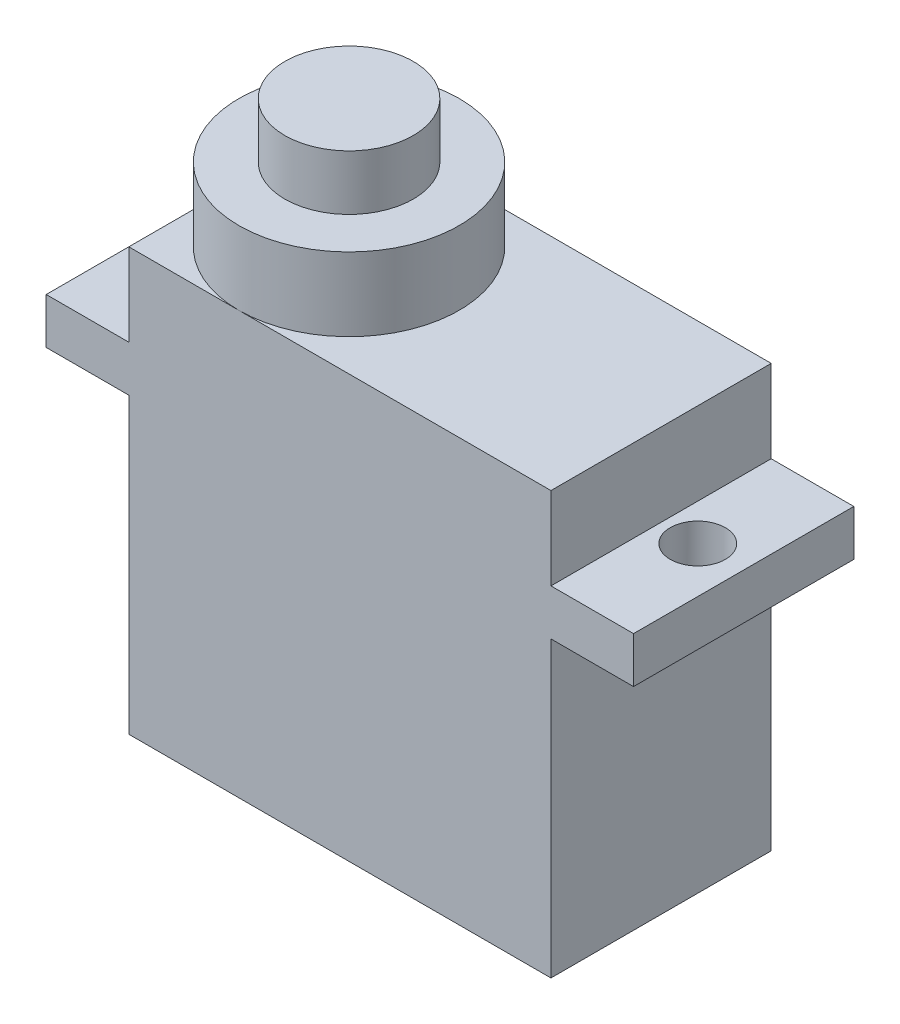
ISO-10303-21;
HEADER;
FILE_DESCRIPTION(('STEP AP214'),'2;1');
FILE_NAME('part.step','',(''),(''),'','','');
FILE_SCHEMA(('AUTOMOTIVE_DESIGN { 1 0 10303 214 1 1 1 1 }'));
ENDSEC;
DATA;
#1=APPLICATION_CONTEXT('core data for automotive mechanical design processes');
#2=APPLICATION_PROTOCOL_DEFINITION('international standard','automotive_design',2000,#1);
#3=PRODUCT_CONTEXT('',#1,'mechanical');
#4=PRODUCT('Part','Part','',(#3));
#5=PRODUCT_RELATED_PRODUCT_CATEGORY('part','',(#4));
#6=PRODUCT_DEFINITION_FORMATION('','',#4);
#7=PRODUCT_DEFINITION_CONTEXT('part definition',#1,'design');
#8=PRODUCT_DEFINITION('design','',#6,#7);
#9=PRODUCT_DEFINITION_SHAPE('','',#8);
#10=(LENGTH_UNIT() NAMED_UNIT(*) SI_UNIT(.MILLI.,.METRE.));
#11=(NAMED_UNIT(*) PLANE_ANGLE_UNIT() SI_UNIT($,.RADIAN.));
#12=(NAMED_UNIT(*) SI_UNIT($,.STERADIAN.) SOLID_ANGLE_UNIT());
#13=UNCERTAINTY_MEASURE_WITH_UNIT(LENGTH_MEASURE(1.E-05),#10,'distance_accuracy_value','');
#14=(GEOMETRIC_REPRESENTATION_CONTEXT(3) GLOBAL_UNCERTAINTY_ASSIGNED_CONTEXT((#13)) GLOBAL_UNIT_ASSIGNED_CONTEXT((#10,
#11,#12)) REPRESENTATION_CONTEXT('',''));
#15=CARTESIAN_POINT('',(0.,0.,0.));
#16=DIRECTION('',(0.,0.,1.));
#17=DIRECTION('',(1.,0.,0.));
#18=AXIS2_PLACEMENT_3D('',#15,#16,#17);
#19=CARTESIAN_POINT('',(0.,23.,0.));
#20=DIRECTION('',(0.,-1.,0.));
#21=DIRECTION('',(0.,0.,-1.));
#22=AXIS2_PLACEMENT_3D('',#19,#20,#21);
#23=PLANE('',#22);
#24=CARTESIAN_POINT('',(10.5,23.,-6.));
#25=DIRECTION('',(0.,1.,0.));
#26=DIRECTION('',(0.,0.,1.));
#27=AXIS2_PLACEMENT_3D('',#24,#25,#26);
#28=CIRCLE('',#27,6.);
#29=CARTESIAN_POINT('',(10.5,23.,0.));
#30=VERTEX_POINT('',#29);
#31=CARTESIAN_POINT('',(10.5,23.,-12.));
#32=VERTEX_POINT('',#31);
#33=EDGE_CURVE('E158',#30,#32,#28,.T.);
#34=ORIENTED_EDGE('',*,*,#33,.F.);
#35=DIRECTION('',(1.,0.,0.));
#36=VECTOR('',#35,1.);
#37=CARTESIAN_POINT('',(0.,23.,0.));
#38=LINE('',#37,#36);
#39=CARTESIAN_POINT('',(27.5,23.,0.));
#40=VERTEX_POINT('',#39);
#41=EDGE_CURVE('E143',#30,#40,#38,.T.);
#42=ORIENTED_EDGE('',*,*,#41,.T.);
#43=DIRECTION('',(0.,0.,-1.));
#44=VECTOR('',#43,1.);
#45=CARTESIAN_POINT('',(27.5,23.,0.));
#46=LINE('',#45,#44);
#47=CARTESIAN_POINT('',(27.5,23.,-12.));
#48=VERTEX_POINT('',#47);
#49=EDGE_CURVE('E253',#40,#48,#46,.T.);
#50=ORIENTED_EDGE('',*,*,#49,.T.);
#51=DIRECTION('',(-1.,0.,0.));
#52=VECTOR('',#51,1.);
#53=CARTESIAN_POINT('',(0.,23.,-12.));
#54=LINE('',#53,#52);
#55=EDGE_CURVE('E160',#48,#32,#54,.T.);
#56=ORIENTED_EDGE('',*,*,#55,.T.);
#57=EDGE_LOOP('',(#34,#42,#50,#56));
#58=FACE_BOUND('',#57,.T.);
#59=ADVANCED_FACE('F37',(#58),#23,.F.);
#60=CARTESIAN_POINT('',(4.5,23.,-6.));
#61=VERTEX_POINT('',#60);
#62=EDGE_CURVE('E46',#32,#61,#28,.T.);
#63=ORIENTED_EDGE('',*,*,#62,.F.);
#64=CARTESIAN_POINT('',(4.5,23.,-12.));
#65=VERTEX_POINT('',#64);
#66=EDGE_CURVE('E142',#32,#65,#54,.T.);
#67=ORIENTED_EDGE('',*,*,#66,.T.);
#68=DIRECTION('',(0.,0.,1.));
#69=VECTOR('',#68,1.);
#70=CARTESIAN_POINT('',(4.5,23.,0.));
#71=LINE('',#70,#69);
#72=EDGE_CURVE('E251',#65,#61,#71,.T.);
#73=ORIENTED_EDGE('',*,*,#72,.T.);
#74=EDGE_LOOP('',(#63,#67,#73));
#75=FACE_BOUND('',#74,.T.);
#76=ADVANCED_FACE('F301',(#75),#23,.F.);
#77=CARTESIAN_POINT('',(0.,23.,0.));
#78=DIRECTION('',(1.,0.,0.));
#79=DIRECTION('',(0.,0.,-1.));
#80=AXIS2_PLACEMENT_3D('',#77,#78,#79);
#81=PLANE('',#80);
#82=DIRECTION('',(0.,-1.,0.));
#83=VECTOR('',#82,1.);
#84=CARTESIAN_POINT('',(0.,23.,0.));
#85=LINE('',#84,#83);
#86=CARTESIAN_POINT('',(0.,18.5,0.));
#87=VERTEX_POINT('',#86);
#88=CARTESIAN_POINT('',(0.,16.,0.));
#89=VERTEX_POINT('',#88);
#90=EDGE_CURVE('E244',#87,#89,#85,.T.);
#91=ORIENTED_EDGE('',*,*,#90,.F.);
#92=DIRECTION('',(0.,0.,1.));
#93=VECTOR('',#92,1.);
#94=CARTESIAN_POINT('',(0.,18.5,-23.));
#95=LINE('',#94,#93);
#96=CARTESIAN_POINT('',(0.,18.5,-12.));
#97=VERTEX_POINT('',#96);
#98=EDGE_CURVE('E189',#97,#87,#95,.T.);
#99=ORIENTED_EDGE('',*,*,#98,.F.);
#100=DIRECTION('',(0.,-1.,0.));
#101=VECTOR('',#100,1.);
#102=CARTESIAN_POINT('',(0.,23.,-12.));
#103=LINE('',#102,#101);
#104=CARTESIAN_POINT('',(0.,16.,-12.));
#105=VERTEX_POINT('',#104);
#106=EDGE_CURVE('E232',#97,#105,#103,.T.);
#107=ORIENTED_EDGE('',*,*,#106,.T.);
#108=DIRECTION('',(0.,0.,1.));
#109=VECTOR('',#108,1.);
#110=CARTESIAN_POINT('',(0.,16.,-23.));
#111=LINE('',#110,#109);
#112=EDGE_CURVE('E214',#105,#89,#111,.T.);
#113=ORIENTED_EDGE('',*,*,#112,.T.);
#114=EDGE_LOOP('',(#91,#99,#107,#113));
#115=FACE_BOUND('',#114,.T.);
#116=ADVANCED_FACE('F39',(#115),#81,.F.);
#117=CARTESIAN_POINT('',(0.,23.,0.));
#118=DIRECTION('',(0.,0.,-1.));
#119=DIRECTION('',(-1.,0.,0.));
#120=AXIS2_PLACEMENT_3D('',#117,#118,#119);
#121=PLANE('',#120);
#122=DIRECTION('',(1.,0.,0.));
#123=VECTOR('',#122,1.);
#124=CARTESIAN_POINT('',(0.,0.,0.));
#125=LINE('',#124,#123);
#126=CARTESIAN_POINT('',(4.5,0.,0.));
#127=VERTEX_POINT('',#126);
#128=CARTESIAN_POINT('',(27.5,0.,0.));
#129=VERTEX_POINT('',#128);
#130=EDGE_CURVE('E229',#127,#129,#125,.T.);
#131=ORIENTED_EDGE('',*,*,#130,.T.);
#132=DIRECTION('',(0.,-1.,0.));
#133=VECTOR('',#132,1.);
#134=CARTESIAN_POINT('',(27.5,0.,0.));
#135=LINE('',#134,#133);
#136=CARTESIAN_POINT('',(27.5,16.,0.));
#137=VERTEX_POINT('',#136);
#138=EDGE_CURVE('E204',#137,#129,#135,.T.);
#139=ORIENTED_EDGE('',*,*,#138,.F.);
#140=DIRECTION('',(-1.,0.,0.));
#141=VECTOR('',#140,1.);
#142=CARTESIAN_POINT('',(32.,16.,0.));
#143=LINE('',#142,#141);
#144=CARTESIAN_POINT('',(32.,16.,0.));
#145=VERTEX_POINT('',#144);
#146=EDGE_CURVE('E182',#145,#137,#143,.T.);
#147=ORIENTED_EDGE('',*,*,#146,.F.);
#148=DIRECTION('',(0.,-1.,0.));
#149=VECTOR('',#148,1.);
#150=CARTESIAN_POINT('',(32.,23.,0.));
#151=LINE('',#150,#149);
#152=CARTESIAN_POINT('',(32.,18.5,0.));
#153=VERTEX_POINT('',#152);
#154=EDGE_CURVE('E241',#153,#145,#151,.T.);
#155=ORIENTED_EDGE('',*,*,#154,.F.);
#156=DIRECTION('',(1.,0.,0.));
#157=VECTOR('',#156,1.);
#158=CARTESIAN_POINT('',(32.,18.5,0.));
#159=LINE('',#158,#157);
#160=CARTESIAN_POINT('',(27.5,18.5,0.));
#161=VERTEX_POINT('',#160);
#162=EDGE_CURVE('E195',#161,#153,#159,.T.);
#163=ORIENTED_EDGE('',*,*,#162,.F.);
#164=DIRECTION('',(0.,-1.,0.));
#165=VECTOR('',#164,1.);
#166=CARTESIAN_POINT('',(27.5,23.,0.));
#167=LINE('',#166,#165);
#168=EDGE_CURVE('E151',#40,#161,#167,.T.);
#169=ORIENTED_EDGE('',*,*,#168,.F.);
#170=ORIENTED_EDGE('',*,*,#41,.F.);
#171=CARTESIAN_POINT('',(4.5,23.,0.));
#172=VERTEX_POINT('',#171);
#173=EDGE_CURVE('E135',#172,#30,#38,.T.);
#174=ORIENTED_EDGE('',*,*,#173,.F.);
#175=DIRECTION('',(0.,1.,0.));
#176=VECTOR('',#175,1.);
#177=CARTESIAN_POINT('',(4.5,23.,0.));
#178=LINE('',#177,#176);
#179=CARTESIAN_POINT('',(4.5,18.5,0.));
#180=VERTEX_POINT('',#179);
#181=EDGE_CURVE('E186',#180,#172,#178,.T.);
#182=ORIENTED_EDGE('',*,*,#181,.F.);
#183=DIRECTION('',(1.,0.,0.));
#184=VECTOR('',#183,1.);
#185=CARTESIAN_POINT('',(0.,18.5,0.));
#186=LINE('',#185,#184);
#187=EDGE_CURVE('E183',#87,#180,#186,.T.);
#188=ORIENTED_EDGE('',*,*,#187,.F.);
#189=ORIENTED_EDGE('',*,*,#90,.T.);
#190=DIRECTION('',(-1.,0.,0.));
#191=VECTOR('',#190,1.);
#192=CARTESIAN_POINT('',(0.,16.,0.));
#193=LINE('',#192,#191);
#194=CARTESIAN_POINT('',(4.5,16.,0.));
#195=VERTEX_POINT('',#194);
#196=EDGE_CURVE('E211',#195,#89,#193,.T.);
#197=ORIENTED_EDGE('',*,*,#196,.F.);
#198=DIRECTION('',(0.,1.,0.));
#199=VECTOR('',#198,1.);
#200=CARTESIAN_POINT('',(4.5,0.,0.));
#201=LINE('',#200,#199);
#202=EDGE_CURVE('E192',#127,#195,#201,.T.);
#203=ORIENTED_EDGE('',*,*,#202,.F.);
#204=EDGE_LOOP('',(#131,#139,#147,#155,#163,#169,#170,#174,#182,#188,#189,#197,#203));
#205=FACE_BOUND('',#204,.T.);
#206=ADVANCED_FACE('F148',(#205),#121,.F.);
#207=CARTESIAN_POINT('',(32.,23.,0.));
#208=DIRECTION('',(-1.,0.,0.));
#209=DIRECTION('',(0.,0.,1.));
#210=AXIS2_PLACEMENT_3D('',#207,#208,#209);
#211=PLANE('',#210);
#212=ORIENTED_EDGE('',*,*,#154,.T.);
#213=DIRECTION('',(0.,0.,1.));
#214=VECTOR('',#213,1.);
#215=CARTESIAN_POINT('',(32.,16.,-23.));
#216=LINE('',#215,#214);
#217=CARTESIAN_POINT('',(32.,16.,-12.));
#218=VERTEX_POINT('',#217);
#219=EDGE_CURVE('E206',#218,#145,#216,.T.);
#220=ORIENTED_EDGE('',*,*,#219,.F.);
#221=DIRECTION('',(0.,-1.,0.));
#222=VECTOR('',#221,1.);
#223=CARTESIAN_POINT('',(32.,23.,-12.));
#224=LINE('',#223,#222);
#225=CARTESIAN_POINT('',(32.,18.5,-12.));
#226=VERTEX_POINT('',#225);
#227=EDGE_CURVE('E238',#226,#218,#224,.T.);
#228=ORIENTED_EDGE('',*,*,#227,.F.);
#229=DIRECTION('',(0.,0.,1.));
#230=VECTOR('',#229,1.);
#231=CARTESIAN_POINT('',(32.,18.5,-23.));
#232=LINE('',#231,#230);
#233=EDGE_CURVE('E187',#226,#153,#232,.T.);
#234=ORIENTED_EDGE('',*,*,#233,.T.);
#235=EDGE_LOOP('',(#212,#220,#228,#234));
#236=FACE_BOUND('',#235,.T.);
#237=ADVANCED_FACE('F268',(#236),#211,.F.);
#238=CARTESIAN_POINT('',(0.,23.,-12.));
#239=DIRECTION('',(0.,0.,1.));
#240=DIRECTION('',(1.,0.,0.));
#241=AXIS2_PLACEMENT_3D('',#238,#239,#240);
#242=PLANE('',#241);
#243=DIRECTION('',(-1.,0.,0.));
#244=VECTOR('',#243,1.);
#245=CARTESIAN_POINT('',(0.,16.,-12.));
#246=LINE('',#245,#244);
#247=CARTESIAN_POINT('',(27.5,16.,-12.));
#248=VERTEX_POINT('',#247);
#249=EDGE_CURVE('E41',#218,#248,#246,.T.);
#250=ORIENTED_EDGE('',*,*,#249,.T.);
#251=DIRECTION('',(0.,-1.,0.));
#252=VECTOR('',#251,1.);
#253=CARTESIAN_POINT('',(27.5,23.,-12.));
#254=LINE('',#253,#252);
#255=CARTESIAN_POINT('',(27.5,0.,-12.));
#256=VERTEX_POINT('',#255);
#257=EDGE_CURVE('E221',#248,#256,#254,.T.);
#258=ORIENTED_EDGE('',*,*,#257,.T.);
#259=DIRECTION('',(-1.,0.,0.));
#260=VECTOR('',#259,1.);
#261=CARTESIAN_POINT('',(0.,0.,-12.));
#262=LINE('',#261,#260);
#263=CARTESIAN_POINT('',(4.5,0.,-12.));
#264=VERTEX_POINT('',#263);
#265=EDGE_CURVE('E155',#256,#264,#262,.T.);
#266=ORIENTED_EDGE('',*,*,#265,.T.);
#267=DIRECTION('',(0.,1.,0.));
#268=VECTOR('',#267,1.);
#269=CARTESIAN_POINT('',(4.49999999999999,23.,-12.));
#270=LINE('',#269,#268);
#271=CARTESIAN_POINT('',(4.5,16.,-12.));
#272=VERTEX_POINT('',#271);
#273=EDGE_CURVE('E217',#264,#272,#270,.T.);
#274=ORIENTED_EDGE('',*,*,#273,.T.);
#275=DIRECTION('',(-1.,0.,0.));
#276=VECTOR('',#275,1.);
#277=CARTESIAN_POINT('',(0.,16.,-12.));
#278=LINE('',#277,#276);
#279=EDGE_CURVE('E255',#272,#105,#278,.T.);
#280=ORIENTED_EDGE('',*,*,#279,.T.);
#281=ORIENTED_EDGE('',*,*,#106,.F.);
#282=DIRECTION('',(1.,0.,0.));
#283=VECTOR('',#282,1.);
#284=CARTESIAN_POINT('',(0.,18.5,-12.));
#285=LINE('',#284,#283);
#286=CARTESIAN_POINT('',(4.5,18.5,-12.));
#287=VERTEX_POINT('',#286);
#288=EDGE_CURVE('E258',#97,#287,#285,.T.);
#289=ORIENTED_EDGE('',*,*,#288,.T.);
#290=DIRECTION('',(0.,1.,0.));
#291=VECTOR('',#290,1.);
#292=CARTESIAN_POINT('',(4.5,23.,-12.));
#293=LINE('',#292,#291);
#294=EDGE_CURVE('E224',#287,#65,#293,.T.);
#295=ORIENTED_EDGE('',*,*,#294,.T.);
#296=ORIENTED_EDGE('',*,*,#66,.F.);
#297=ORIENTED_EDGE('',*,*,#55,.F.);
#298=DIRECTION('',(0.,-1.,0.));
#299=VECTOR('',#298,1.);
#300=CARTESIAN_POINT('',(27.5,23.,-12.));
#301=LINE('',#300,#299);
#302=CARTESIAN_POINT('',(27.5,18.5,-12.));
#303=VERTEX_POINT('',#302);
#304=EDGE_CURVE('E227',#48,#303,#301,.T.);
#305=ORIENTED_EDGE('',*,*,#304,.T.);
#306=DIRECTION('',(1.,0.,0.));
#307=VECTOR('',#306,1.);
#308=CARTESIAN_POINT('',(0.,18.5,-12.));
#309=LINE('',#308,#307);
#310=EDGE_CURVE('E167',#303,#226,#309,.T.);
#311=ORIENTED_EDGE('',*,*,#310,.T.);
#312=ORIENTED_EDGE('',*,*,#227,.T.);
#313=EDGE_LOOP('',(#250,#258,#266,#274,#280,#281,#289,#295,#296,#297,#305,#311,#312));
#314=FACE_BOUND('',#313,.T.);
#315=ADVANCED_FACE('F263',(#314),#242,.F.);
#316=EDGE_CURVE('E54',#61,#30,#28,.T.);
#317=ORIENTED_EDGE('',*,*,#316,.F.);
#318=EDGE_CURVE('E138',#61,#172,#71,.T.);
#319=ORIENTED_EDGE('',*,*,#318,.T.);
#320=ORIENTED_EDGE('',*,*,#173,.T.);
#321=EDGE_LOOP('',(#317,#319,#320));
#322=FACE_BOUND('',#321,.T.);
#323=ADVANCED_FACE('F137',(#322),#23,.F.);
#324=CARTESIAN_POINT('',(0.,0.,0.));
#325=DIRECTION('',(0.,-1.,0.));
#326=DIRECTION('',(0.,0.,-1.));
#327=AXIS2_PLACEMENT_3D('',#324,#325,#326);
#328=PLANE('',#327);
#329=DIRECTION('',(0.,0.,-1.));
#330=VECTOR('',#329,1.);
#331=CARTESIAN_POINT('',(27.5,0.,0.));
#332=LINE('',#331,#330);
#333=EDGE_CURVE('E249',#129,#256,#332,.T.);
#334=ORIENTED_EDGE('',*,*,#333,.F.);
#335=ORIENTED_EDGE('',*,*,#130,.F.);
#336=DIRECTION('',(0.,0.,1.));
#337=VECTOR('',#336,1.);
#338=CARTESIAN_POINT('',(4.5,0.,0.));
#339=LINE('',#338,#337);
#340=EDGE_CURVE('E247',#264,#127,#339,.T.);
#341=ORIENTED_EDGE('',*,*,#340,.F.);
#342=ORIENTED_EDGE('',*,*,#265,.F.);
#343=EDGE_LOOP('',(#334,#335,#341,#342));
#344=FACE_BOUND('',#343,.T.);
#345=ADVANCED_FACE('F282',(#344),#328,.T.);
#346=CARTESIAN_POINT('',(0.,16.,-23.));
#347=DIRECTION('',(0.,1.,0.));
#348=DIRECTION('',(0.,0.,1.));
#349=AXIS2_PLACEMENT_3D('',#346,#347,#348);
#350=PLANE('',#349);
#351=CARTESIAN_POINT('',(2.5,16.,-6.));
#352=DIRECTION('',(0.,1.,0.));
#353=DIRECTION('',(0.,0.,1.));
#354=AXIS2_PLACEMENT_3D('',#351,#352,#353);
#355=CIRCLE('',#354,1.5);
#356=CARTESIAN_POINT('',(2.5,16.,-4.5));
#357=VERTEX_POINT('',#356);
#358=EDGE_CURVE('E179',#357,#357,#355,.T.);
#359=ORIENTED_EDGE('',*,*,#358,.T.);
#360=EDGE_LOOP('',(#359));
#361=FACE_BOUND('',#360,.T.);
#362=DIRECTION('',(0.,0.,1.));
#363=VECTOR('',#362,1.);
#364=CARTESIAN_POINT('',(4.5,16.,-23.));
#365=LINE('',#364,#363);
#366=EDGE_CURVE('E213',#272,#195,#365,.T.);
#367=ORIENTED_EDGE('',*,*,#366,.T.);
#368=ORIENTED_EDGE('',*,*,#196,.T.);
#369=ORIENTED_EDGE('',*,*,#112,.F.);
#370=ORIENTED_EDGE('',*,*,#279,.F.);
#371=EDGE_LOOP('',(#367,#368,#369,#370));
#372=FACE_BOUND('',#371,.T.);
#373=ADVANCED_FACE('F290',(#361,#372),#350,.F.);
#374=CARTESIAN_POINT('',(4.5,0.,-23.));
#375=DIRECTION('',(1.,0.,0.));
#376=DIRECTION('',(0.,1.,0.));
#377=AXIS2_PLACEMENT_3D('',#374,#375,#376);
#378=PLANE('',#377);
#379=ORIENTED_EDGE('',*,*,#340,.T.);
#380=ORIENTED_EDGE('',*,*,#202,.T.);
#381=ORIENTED_EDGE('',*,*,#366,.F.);
#382=ORIENTED_EDGE('',*,*,#273,.F.);
#383=EDGE_LOOP('',(#379,#380,#381,#382));
#384=FACE_BOUND('',#383,.T.);
#385=ADVANCED_FACE('F287',(#384),#378,.F.);
#386=CARTESIAN_POINT('',(32.,16.,-23.));
#387=DIRECTION('',(0.,1.,0.));
#388=DIRECTION('',(-1.,0.,0.));
#389=AXIS2_PLACEMENT_3D('',#386,#387,#388);
#390=PLANE('',#389);
#391=CARTESIAN_POINT('',(29.5,16.,-6.));
#392=DIRECTION('',(0.,1.,0.));
#393=DIRECTION('',(-1.,0.,0.));
#394=AXIS2_PLACEMENT_3D('',#391,#392,#393);
#395=CIRCLE('',#394,1.5);
#396=CARTESIAN_POINT('',(28.,16.,-6.));
#397=VERTEX_POINT('',#396);
#398=EDGE_CURVE('E173',#397,#397,#395,.T.);
#399=ORIENTED_EDGE('',*,*,#398,.T.);
#400=EDGE_LOOP('',(#399));
#401=FACE_BOUND('',#400,.T.);
#402=ORIENTED_EDGE('',*,*,#219,.T.);
#403=ORIENTED_EDGE('',*,*,#146,.T.);
#404=DIRECTION('',(0.,0.,1.));
#405=VECTOR('',#404,1.);
#406=CARTESIAN_POINT('',(27.5,16.,-23.));
#407=LINE('',#406,#405);
#408=EDGE_CURVE('E196',#248,#137,#407,.T.);
#409=ORIENTED_EDGE('',*,*,#408,.F.);
#410=ORIENTED_EDGE('',*,*,#249,.F.);
#411=EDGE_LOOP('',(#402,#403,#409,#410));
#412=FACE_BOUND('',#411,.T.);
#413=ADVANCED_FACE('F272',(#401,#412),#390,.F.);
#414=CARTESIAN_POINT('',(27.5,0.,-23.));
#415=DIRECTION('',(-1.,0.,0.));
#416=DIRECTION('',(0.,0.,1.));
#417=AXIS2_PLACEMENT_3D('',#414,#415,#416);
#418=PLANE('',#417);
#419=ORIENTED_EDGE('',*,*,#408,.T.);
#420=ORIENTED_EDGE('',*,*,#138,.T.);
#421=ORIENTED_EDGE('',*,*,#333,.T.);
#422=ORIENTED_EDGE('',*,*,#257,.F.);
#423=EDGE_LOOP('',(#419,#420,#421,#422));
#424=FACE_BOUND('',#423,.T.);
#425=ADVANCED_FACE('F279',(#424),#418,.F.);
#426=CARTESIAN_POINT('',(0.,18.5,-23.));
#427=DIRECTION('',(0.,-1.,0.));
#428=DIRECTION('',(0.,0.,-1.));
#429=AXIS2_PLACEMENT_3D('',#426,#427,#428);
#430=PLANE('',#429);
#431=CARTESIAN_POINT('',(2.5,18.5,-6.));
#432=DIRECTION('',(0.,1.,0.));
#433=DIRECTION('',(0.,0.,1.));
#434=AXIS2_PLACEMENT_3D('',#431,#432,#433);
#435=CIRCLE('',#434,1.5);
#436=CARTESIAN_POINT('',(2.5,18.5,-4.5));
#437=VERTEX_POINT('',#436);
#438=EDGE_CURVE('E170',#437,#437,#435,.T.);
#439=ORIENTED_EDGE('',*,*,#438,.F.);
#440=EDGE_LOOP('',(#439));
#441=FACE_BOUND('',#440,.T.);
#442=ORIENTED_EDGE('',*,*,#98,.T.);
#443=ORIENTED_EDGE('',*,*,#187,.T.);
#444=DIRECTION('',(0.,0.,1.));
#445=VECTOR('',#444,1.);
#446=CARTESIAN_POINT('',(4.5,18.5,-23.));
#447=LINE('',#446,#445);
#448=EDGE_CURVE('E190',#287,#180,#447,.T.);
#449=ORIENTED_EDGE('',*,*,#448,.F.);
#450=ORIENTED_EDGE('',*,*,#288,.F.);
#451=EDGE_LOOP('',(#442,#443,#449,#450));
#452=FACE_BOUND('',#451,.T.);
#453=ADVANCED_FACE('F297',(#441,#452),#430,.F.);
#454=CARTESIAN_POINT('',(4.5,23.,-23.));
#455=DIRECTION('',(1.,0.,0.));
#456=DIRECTION('',(0.,0.,-1.));
#457=AXIS2_PLACEMENT_3D('',#454,#455,#456);
#458=PLANE('',#457);
#459=ORIENTED_EDGE('',*,*,#448,.T.);
#460=ORIENTED_EDGE('',*,*,#181,.T.);
#461=ORIENTED_EDGE('',*,*,#318,.F.);
#462=ORIENTED_EDGE('',*,*,#72,.F.);
#463=ORIENTED_EDGE('',*,*,#294,.F.);
#464=EDGE_LOOP('',(#459,#460,#461,#462,#463));
#465=FACE_BOUND('',#464,.T.);
#466=ADVANCED_FACE('F300',(#465),#458,.F.);
#467=CARTESIAN_POINT('',(32.,18.5,-23.));
#468=DIRECTION('',(0.,-1.,0.));
#469=DIRECTION('',(1.,0.,0.));
#470=AXIS2_PLACEMENT_3D('',#467,#468,#469);
#471=PLANE('',#470);
#472=CARTESIAN_POINT('',(29.5,18.5,-6.));
#473=DIRECTION('',(0.,1.,0.));
#474=DIRECTION('',(0.,0.,1.));
#475=AXIS2_PLACEMENT_3D('',#472,#473,#474);
#476=CIRCLE('',#475,1.5);
#477=CARTESIAN_POINT('',(29.5,18.5,-4.5));
#478=VERTEX_POINT('',#477);
#479=EDGE_CURVE('E174',#478,#478,#476,.T.);
#480=ORIENTED_EDGE('',*,*,#479,.F.);
#481=EDGE_LOOP('',(#480));
#482=FACE_BOUND('',#481,.T.);
#483=DIRECTION('',(0.,0.,1.));
#484=VECTOR('',#483,1.);
#485=CARTESIAN_POINT('',(27.5,18.5,-23.));
#486=LINE('',#485,#484);
#487=EDGE_CURVE('E198',#303,#161,#486,.T.);
#488=ORIENTED_EDGE('',*,*,#487,.T.);
#489=ORIENTED_EDGE('',*,*,#162,.T.);
#490=ORIENTED_EDGE('',*,*,#233,.F.);
#491=ORIENTED_EDGE('',*,*,#310,.F.);
#492=EDGE_LOOP('',(#488,#489,#490,#491));
#493=FACE_BOUND('',#492,.T.);
#494=ADVANCED_FACE('F371',(#482,#493),#471,.F.);
#495=CARTESIAN_POINT('',(27.5,23.,-23.));
#496=DIRECTION('',(-1.,0.,0.));
#497=DIRECTION('',(0.,0.,1.));
#498=AXIS2_PLACEMENT_3D('',#495,#496,#497);
#499=PLANE('',#498);
#500=ORIENTED_EDGE('',*,*,#49,.F.);
#501=ORIENTED_EDGE('',*,*,#168,.T.);
#502=ORIENTED_EDGE('',*,*,#487,.F.);
#503=ORIENTED_EDGE('',*,*,#304,.F.);
#504=EDGE_LOOP('',(#500,#501,#502,#503));
#505=FACE_BOUND('',#504,.T.);
#506=ADVANCED_FACE('F365',(#505),#499,.F.);
#507=CARTESIAN_POINT('',(29.5,-4.5,-6.));
#508=DIRECTION('',(0.,1.,0.));
#509=DIRECTION('',(0.,0.,1.));
#510=AXIS2_PLACEMENT_3D('',#507,#508,#509);
#511=CYLINDRICAL_SURFACE('',#510,1.5);
#512=ORIENTED_EDGE('',*,*,#479,.T.);
#513=EDGE_LOOP('',(#512));
#514=FACE_BOUND('',#513,.T.);
#515=ORIENTED_EDGE('',*,*,#398,.F.);
#516=EDGE_LOOP('',(#515));
#517=FACE_BOUND('',#516,.T.);
#518=ADVANCED_FACE('F370',(#514,#517),#511,.F.);
#519=CARTESIAN_POINT('',(2.5,-4.5,-6.));
#520=DIRECTION('',(0.,1.,0.));
#521=DIRECTION('',(0.,0.,1.));
#522=AXIS2_PLACEMENT_3D('',#519,#520,#521);
#523=CYLINDRICAL_SURFACE('',#522,1.5);
#524=ORIENTED_EDGE('',*,*,#438,.T.);
#525=EDGE_LOOP('',(#524));
#526=FACE_BOUND('',#525,.T.);
#527=ORIENTED_EDGE('',*,*,#358,.F.);
#528=EDGE_LOOP('',(#527));
#529=FACE_BOUND('',#528,.T.);
#530=ADVANCED_FACE('F413',(#526,#529),#523,.F.);
#531=CARTESIAN_POINT('',(10.5,27.,-6.));
#532=DIRECTION('',(0.,-1.,0.));
#533=DIRECTION('',(0.,0.,-1.));
#534=AXIS2_PLACEMENT_3D('',#531,#532,#533);
#535=CYLINDRICAL_SURFACE('',#534,6.);
#536=CARTESIAN_POINT('',(10.5,27.,-6.));
#537=DIRECTION('',(0.,1.,0.));
#538=DIRECTION('',(0.,0.,1.));
#539=AXIS2_PLACEMENT_3D('',#536,#537,#538);
#540=CIRCLE('',#539,6.);
#541=CARTESIAN_POINT('',(10.5,27.,0.));
#542=VERTEX_POINT('',#541);
#543=EDGE_CURVE('E162',#542,#542,#540,.T.);
#544=ORIENTED_EDGE('',*,*,#543,.F.);
#545=EDGE_LOOP('',(#544));
#546=FACE_BOUND('',#545,.T.);
#547=ORIENTED_EDGE('',*,*,#33,.T.);
#548=ORIENTED_EDGE('',*,*,#62,.T.);
#549=ORIENTED_EDGE('',*,*,#316,.T.);
#550=EDGE_LOOP('',(#547,#548,#549));
#551=FACE_BOUND('',#550,.T.);
#552=ADVANCED_FACE('F165',(#546,#551),#535,.T.);
#553=CARTESIAN_POINT('',(10.5,27.,-6.));
#554=DIRECTION('',(0.,1.,0.));
#555=DIRECTION('',(0.,0.,1.));
#556=AXIS2_PLACEMENT_3D('',#553,#554,#555);
#557=PLANE('',#556);
#558=CARTESIAN_POINT('',(10.5,27.,-6.));
#559=DIRECTION('',(0.,1.,0.));
#560=DIRECTION('',(0.,0.,1.));
#561=AXIS2_PLACEMENT_3D('',#558,#559,#560);
#562=CIRCLE('',#561,3.5);
#563=CARTESIAN_POINT('',(10.5,27.,-2.5));
#564=VERTEX_POINT('',#563);
#565=EDGE_CURVE('E11',#564,#564,#562,.T.);
#566=ORIENTED_EDGE('',*,*,#565,.F.);
#567=EDGE_LOOP('',(#566));
#568=FACE_BOUND('',#567,.T.);
#569=ORIENTED_EDGE('',*,*,#543,.T.);
#570=EDGE_LOOP('',(#569));
#571=FACE_BOUND('',#570,.T.);
#572=ADVANCED_FACE('F443',(#568,#571),#557,.T.);
#573=CARTESIAN_POINT('',(10.5,30.,-6.));
#574=DIRECTION('',(0.,-1.,0.));
#575=DIRECTION('',(0.,0.,-1.));
#576=AXIS2_PLACEMENT_3D('',#573,#574,#575);
#577=CYLINDRICAL_SURFACE('',#576,3.5);
#578=CARTESIAN_POINT('',(10.5,30.,-6.));
#579=DIRECTION('',(0.,1.,0.));
#580=DIRECTION('',(0.,0.,1.));
#581=AXIS2_PLACEMENT_3D('',#578,#579,#580);
#582=CIRCLE('',#581,3.5);
#583=CARTESIAN_POINT('',(10.5,30.,-2.5));
#584=VERTEX_POINT('',#583);
#585=EDGE_CURVE('E163',#584,#584,#582,.T.);
#586=ORIENTED_EDGE('',*,*,#585,.F.);
#587=EDGE_LOOP('',(#586));
#588=FACE_BOUND('',#587,.T.);
#589=ORIENTED_EDGE('',*,*,#565,.T.);
#590=EDGE_LOOP('',(#589));
#591=FACE_BOUND('',#590,.T.);
#592=ADVANCED_FACE('F453',(#588,#591),#577,.T.);
#593=CARTESIAN_POINT('',(10.5,30.,-6.));
#594=DIRECTION('',(0.,1.,0.));
#595=DIRECTION('',(0.,0.,1.));
#596=AXIS2_PLACEMENT_3D('',#593,#594,#595);
#597=PLANE('',#596);
#598=ORIENTED_EDGE('',*,*,#585,.T.);
#599=EDGE_LOOP('',(#598));
#600=FACE_BOUND('',#599,.T.);
#601=ADVANCED_FACE('F462',(#600),#597,.T.);
#602=CLOSED_SHELL('',(#59,#76,#116,#206,#237,#315,#323,#345,#373,#385,#413,#425,#453,#466,#494,
#506,#518,#530,#552,#572,#592,#601));
#603=MANIFOLD_SOLID_BREP('B2',#602);
#604=ADVANCED_BREP_SHAPE_REPRESENTATION('',(#18,#603),#14);
#605=SHAPE_DEFINITION_REPRESENTATION(#9,#604);
ENDSEC;
END-ISO-10303-21;
